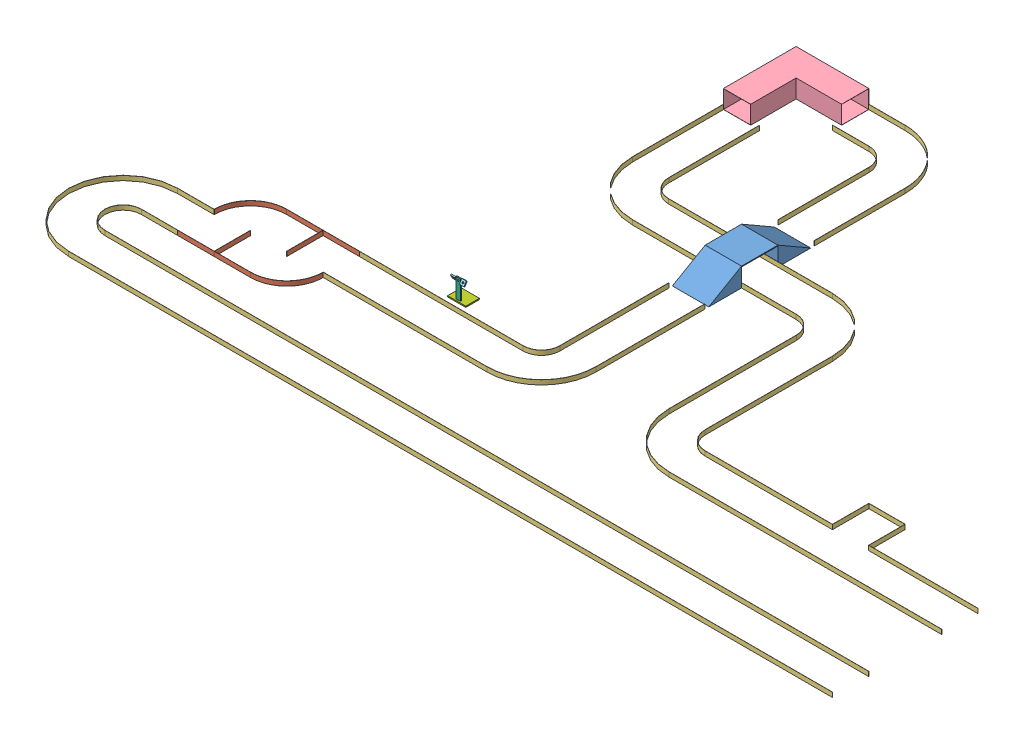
SolidWorks assembly field_2018.SLDASM, configuration Default (file format 10000). Lengths in mm.
Overall size (13716 342.9 8839.2).
9 component instances, 7 part files, 13 mates.
Components (placement in the parent):
- bridge-1: bridge.SLDPRT [Default] at (-7010.4 0 -5486.4) x (0 0 -1) z (1 0 0) size (1709.45 317.5 609.6)
- slalom-1: slalom.SLDPRT [Default] at (-11277.6 0 -1828.8) size (1828.8 76.2 1219.2)
- track-1: track.SLDPRT [Default] at origin size (13716 76.2 8839.2)
- tunnel-1: tunnel.SLDPRT [Default] at (-8839.2 0 -8229.6) size (1219.2 304.8 1219.2)
- deposit-1: deposit.SLDASM [Default] at (-8885.7447 0 -2664.4146) size (304.8 342.9 228.6)
  - square_target-1: square_target.SLDPRT [Default] at (76.2 304.8 41.275) x (1 0 0) z (0 0.5 0.866025) size (76.2 76.2 19.05)
  - circular_target-1: circular_target.SLDPRT [Default] at (0 304.8 41.275) size (76.2 323.85 19.05)
  - square_target-2: square_target.SLDPRT [Default] at (-76.2 304.8 41.275) x (1 0 0) z (0 0.5 -0.866025) size (76.2 76.2 19.05)
  - targetbase-1: targetbase.SLDPRT [Default] at origin size (304.8 19.05 228.6)
Mates (geometry in assembly coordinates):
- Coincident1: coincident anti-aligned: plane of track-1 through (-12801.6 0 -914.4) normal (0 -1 0); plane of assembly through (0 0 0) normal (0 1 0)
- Coincident2: coincident anti-aligned: plane of slalom-1 through (-11277.6 0 -1828.8) normal (0 -1 0); plane of assembly through (0 0 0) normal (0 1 0)
- Coincident3: coincident anti-aligned: line of slalom-1 through (-12192 76.2 -1219.2) axis (0 0 -1); line of track-1 through (-12192 76.2 -1221.74) axis (0 0 1)
- Coincident4: coincident anti-aligned: line of slalom-1 through (-10972.8 76.2 -1219.2) axis (-1 0 0); line of track-1 through (-12801.6 76.2 -1219.2) axis (1 0 0)
- Coincident5: coincident anti-aligned: plane of tunnel-1 through (-8839.2 0 -8229.6) normal (0 -1 0); plane of assembly through (0 0 0) normal (0 1 0)
- Coincident6: coincident anti-aligned: line of track-1 through (-9448.8 0 -7620) axis (0 1 0); line of tunnel-1 through (-9448.8 304.8 -7620) axis (0 -1 0)
- Coincident7: coincident anti-aligned: plane of bridge-1 through (-6705.6 0 -6341.1261) normal (0 -1 0); plane of assembly through (0 0 0) normal (0 1 0)
- Coincident8: coincident anti-aligned: plane of bridge-1 through (-7315.2 0 -5181.6) normal (0 0 -1); plane of track-1 through (-5791.2 76.2 -5181.6) normal (0 0 1)
- Coincident9: coincident aligned: plane of bridge-1 through (-6705.6 0 -5486.4) normal (1 0 0); plane of track-1 through (-6705.6 76.2 -4572) normal (1 0 0)
- Coincident10: coincident aligned: plane of track-1 through (0 0 0) normal (0 0 1); plane of assembly through (0 0 0) normal (0 0 1)
- Coincident11: coincident aligned: plane of track-1 through (0 0 0) normal (1 0 0); plane of assembly through (0 0 0) normal (1 0 0)
- Coincident12: coincident aligned: plane of track-1 through (-9448.8 76.2 -8839.2) normal (0 0 -1); plane of tunnel-1 through (-9448.8 304.8 -8839.2) normal (0 0 -1)
- Coincident13: coincident anti-aligned: plane of deposit-1/targetbase-1 through (-8885.7447 0 -2664.4146) normal (0 -1 0); plane of assembly through (0 0 0) normal (0 1 0)
